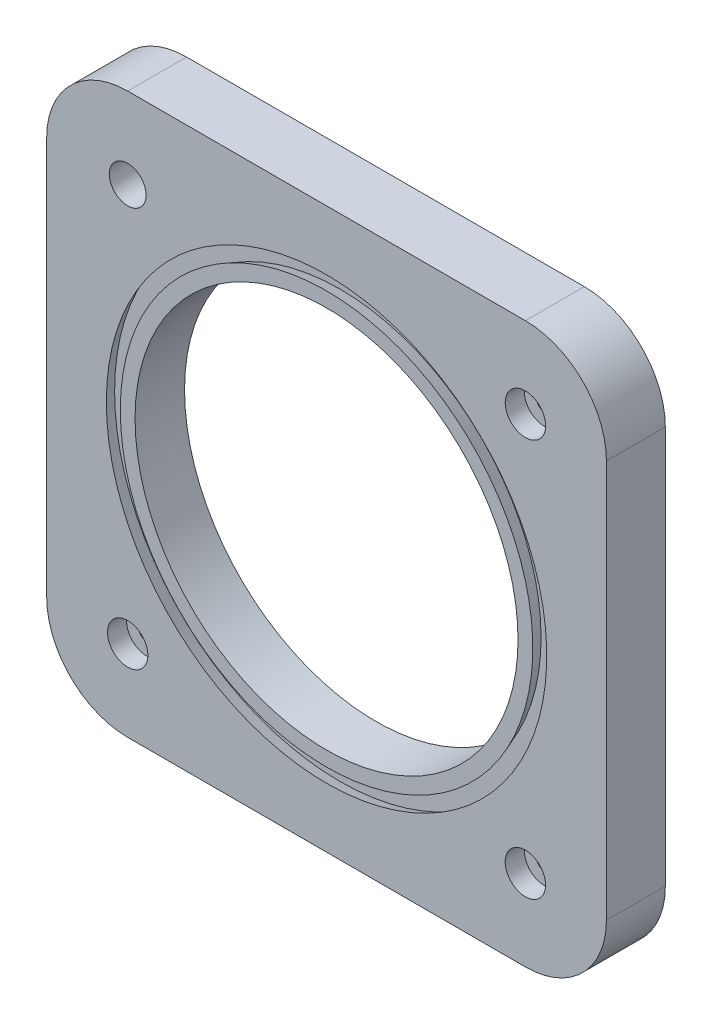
from build123d import *

# Parameters (mm, degrees)
SKETCH1_R          = 82.55
SKETCH1_R_2        = 3.3655
SKETCH1_R_3        = 7.9375
BASE_EXTRUDE_DEPTH = 25.4
SKETCH6_R          = 6.477
CUT_EXTRUDE3_DEPTH = 2.54
SKETCH7_R          = 8.7122
CUT_EXTRUDE4_DEPTH = 8.255
SKETCH8_R          = 95.5675
SKETCH8_R_2        = 76.2
CUT_EXTRUDE5_DEPTH = 4.064


with BuildPart() as part:
    # Sketch1 → Base-Extrude (new body)
    with BuildSketch(Plane.XY):
        with BuildLine():
            Line((120.65, 85.725), (120.65, -85.725))
            ThreePointArc((120.65, -85.725), (110.420704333, -110.420704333), (85.725, -120.65))
            Line((85.725, -120.65), (-85.725, -120.65))
            ThreePointArc((-85.725, -120.65), (-110.420704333, -110.420704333), (-120.65, -85.725))
            Line((-120.65, -85.725), (-120.65, 85.725))
            ThreePointArc((-120.65, 85.725), (-110.420704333, 110.420704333), (-85.725, 120.65))
            Line((-85.725, 120.65), (85.725, 120.65))
            ThreePointArc((85.725, 120.65), (110.420704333, 110.420704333), (120.65, 85.725))
        make_face()
        with Locations(Location((0, 0, 0), (0, 0, 180))):
            Circle(SKETCH1_R, mode=Mode.SUBTRACT)
        with Locations(Location((-85.725, -85.725, 0), (0, 0, 180))):
            Circle(SKETCH1_R_2, mode=Mode.SUBTRACT)
        with Locations(Location((85.725, 85.725, 0), (0, 0, 180))):
            Circle(SKETCH1_R_2, mode=Mode.SUBTRACT)
        with Locations(Location((85.725, -85.725, 0), (0, 0, 180))):
            Circle(SKETCH1_R_2, mode=Mode.SUBTRACT)
        with Locations(Location((-85.725, 85.725, 0), (0, 0, 180))):
            Circle(SKETCH1_R_3, mode=Mode.SUBTRACT)
    extrude(amount=BASE_EXTRUDE_DEPTH)

    # Cut-Sweep1: sweep along a path in Sketch3
    with BuildLine(Plane.XY.offset(25.4)) as cut_sweep1_path:
        CenterArc((0, 0), 94.9325, 0, 360)
    # Sketch4 → Cut-Sweep1 (sweep, cut)
    with BuildSketch(Plane(origin=(0, 0, 0), x_dir=(0, 0, -1), z_dir=(1, 0, 0))):
        Polygon((-19.6596, 97.101616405), (-25.4, 94.9325), (-25.4, 88.9127), (-19.6596, 86.743583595), align=None)
    sweep(path=cut_sweep1_path.line, mode=Mode.SUBTRACT)

    # Sketch6 → Cut-Extrude3 (cut)
    with BuildSketch(Plane(origin=(0, 0, 0), x_dir=(-1, 0, 0), z_dir=(0, 0, -1))):
        with Locations((85.725, -85.725)):
            Circle(SKETCH6_R)
        with Locations(Location((-85.725, -85.725, 0), (0, 0, 180))):
            Circle(SKETCH6_R)
        with Locations((-85.725, 85.725)):
            Circle(SKETCH6_R)
    extrude(amount=-CUT_EXTRUDE3_DEPTH, mode=Mode.SUBTRACT)

    # Sketch7 → Cut-Extrude4 (cut)
    with BuildSketch(Plane.XY.offset(25.4)):
        with Locations((85.725, -85.725)):
            Circle(SKETCH7_R)
        with Locations(Location((85.725, 85.725, 0), (0, 0, 180))):
            Circle(SKETCH7_R)
        with Locations(Location((-85.725, -85.725, 0), (0, 0, 180))):
            Circle(SKETCH7_R)
    extrude(amount=-CUT_EXTRUDE4_DEPTH, mode=Mode.SUBTRACT)

    # Sketch8 → Cut-Extrude5 (cut)
    with BuildSketch(Plane(origin=(0, 0, 0), x_dir=(-1, 0, 0), z_dir=(0, 0, -1))):
        Circle(SKETCH8_R)
        Circle(SKETCH8_R_2, mode=Mode.SUBTRACT)
    extrude(amount=-CUT_EXTRUDE5_DEPTH, mode=Mode.SUBTRACT)


solid = part.part
